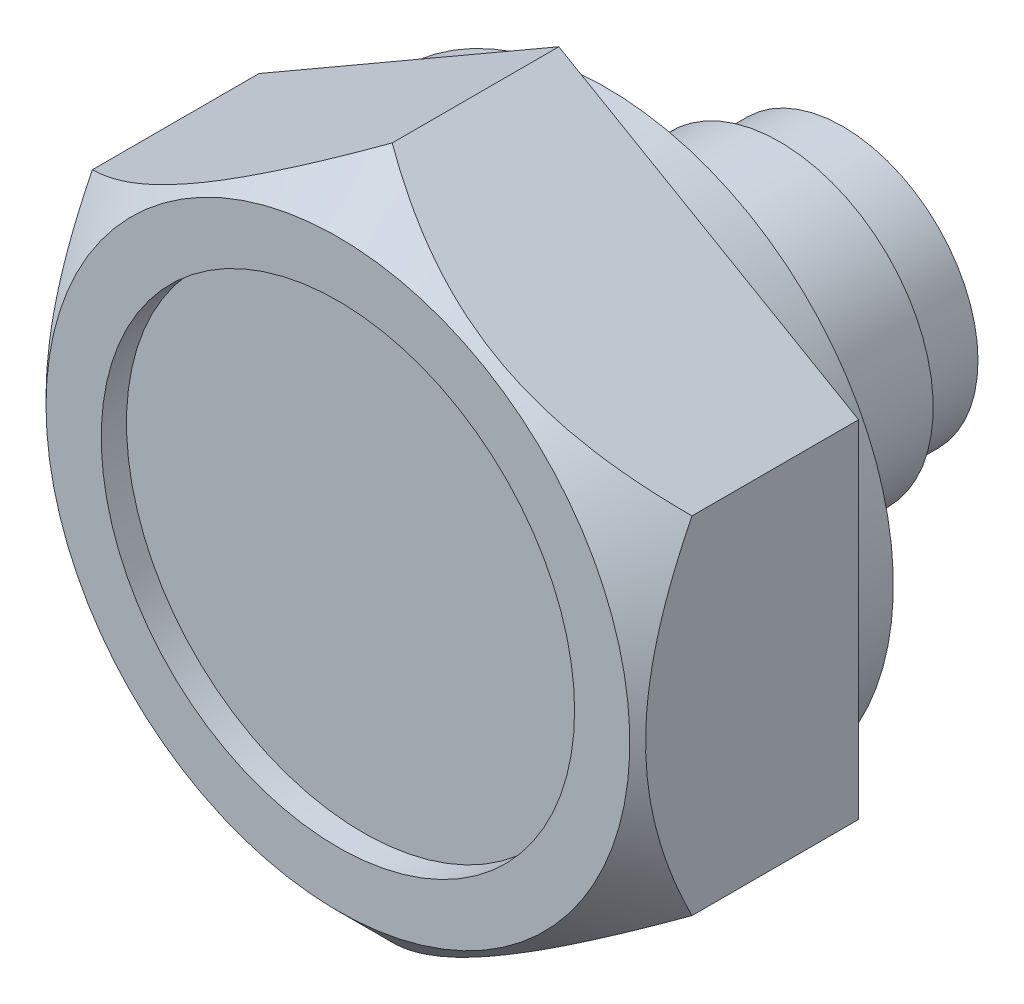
ISO-10303-21;
HEADER;
FILE_DESCRIPTION(('STEP AP214'),'2;1');
FILE_NAME('part.step','',(''),(''),'','','');
FILE_SCHEMA(('AUTOMOTIVE_DESIGN { 1 0 10303 214 1 1 1 1 }'));
ENDSEC;
DATA;
#1=APPLICATION_CONTEXT('core data for automotive mechanical design processes');
#2=APPLICATION_PROTOCOL_DEFINITION('international standard','automotive_design',2000,#1);
#3=PRODUCT_CONTEXT('',#1,'mechanical');
#4=PRODUCT('Part','Part','',(#3));
#5=PRODUCT_RELATED_PRODUCT_CATEGORY('part','',(#4));
#6=PRODUCT_DEFINITION_FORMATION('','',#4);
#7=PRODUCT_DEFINITION_CONTEXT('part definition',#1,'design');
#8=PRODUCT_DEFINITION('design','',#6,#7);
#9=PRODUCT_DEFINITION_SHAPE('','',#8);
#10=(LENGTH_UNIT() NAMED_UNIT(*) SI_UNIT(.MILLI.,.METRE.));
#11=(NAMED_UNIT(*) PLANE_ANGLE_UNIT() SI_UNIT($,.RADIAN.));
#12=(NAMED_UNIT(*) SI_UNIT($,.STERADIAN.) SOLID_ANGLE_UNIT());
#13=UNCERTAINTY_MEASURE_WITH_UNIT(LENGTH_MEASURE(1.E-05),#10,'distance_accuracy_value','');
#14=(GEOMETRIC_REPRESENTATION_CONTEXT(3) GLOBAL_UNCERTAINTY_ASSIGNED_CONTEXT((#13)) GLOBAL_UNIT_ASSIGNED_CONTEXT((#10,
#11,#12)) REPRESENTATION_CONTEXT('',''));
#15=CARTESIAN_POINT('',(0.,0.,0.));
#16=DIRECTION('',(0.,0.,1.));
#17=DIRECTION('',(1.,0.,0.));
#18=AXIS2_PLACEMENT_3D('',#15,#16,#17);
#19=CARTESIAN_POINT('',(0.,9.1,1.5));
#20=DIRECTION('',(0.,0.,-1.));
#21=DIRECTION('',(-1.,0.,0.));
#22=AXIS2_PLACEMENT_3D('',#19,#20,#21);
#23=PLANE('',#22);
#24=CARTESIAN_POINT('',(0.,0.,1.5));
#25=DIRECTION('',(0.,0.,-1.));
#26=DIRECTION('',(-1.,0.,0.));
#27=AXIS2_PLACEMENT_3D('',#24,#25,#26);
#28=CIRCLE('',#27,9.1);
#29=CARTESIAN_POINT('',(-9.1,0.,1.5));
#30=VERTEX_POINT('',#29);
#31=EDGE_CURVE('E131',#30,#30,#28,.T.);
#32=ORIENTED_EDGE('',*,*,#31,.F.);
#33=EDGE_LOOP('',(#32));
#34=FACE_BOUND('',#33,.T.);
#35=DIRECTION('',(-0.866025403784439,-0.5,0.));
#36=VECTOR('',#35,1.);
#37=CARTESIAN_POINT('',(-0.809584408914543,10.5022413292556,1.5));
#38=LINE('',#37,#36);
#39=CARTESIAN_POINT('',(-1.18559675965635E-11,10.9696551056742,1.5));
#40=VERTEX_POINT('',#39);
#41=CARTESIAN_POINT('',(-9.49999999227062,5.4848275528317,1.5));
#42=VERTEX_POINT('',#41);
#43=EDGE_CURVE('E124',#40,#42,#38,.T.);
#44=ORIENTED_EDGE('',*,*,#43,.F.);
#45=DIRECTION('',(-0.866025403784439,0.5,0.));
#46=VECTOR('',#45,1.);
#47=CARTESIAN_POINT('',(0.809584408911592,10.5022413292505,1.5));
#48=LINE('',#47,#46);
#49=CARTESIAN_POINT('',(9.49999999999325,5.4848275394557,1.5));
#50=VERTEX_POINT('',#49);
#51=EDGE_CURVE('E120',#50,#40,#48,.T.);
#52=ORIENTED_EDGE('',*,*,#51,.F.);
#53=DIRECTION('',(7.05455308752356E-10,1.,0.));
#54=VECTOR('',#53,1.);
#55=CARTESIAN_POINT('',(9.5000000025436,9.09999999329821,1.5));
#56=LINE('',#55,#54);
#57=CARTESIAN_POINT('',(9.49999999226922,-5.48482755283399,1.5));
#58=VERTEX_POINT('',#57);
#59=EDGE_CURVE('E42',#58,#50,#56,.T.);
#60=ORIENTED_EDGE('',*,*,#59,.F.);
#61=DIRECTION('',(0.866025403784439,0.5,0.));
#62=VECTOR('',#61,1.);
#63=CARTESIAN_POINT('',(8.69041558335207,-5.95224132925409,1.5));
#64=LINE('',#63,#62);
#65=CARTESIAN_POINT('',(-3.68108321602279E-12,-10.9696551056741,1.5));
#66=VERTEX_POINT('',#65);
#67=EDGE_CURVE('E37',#66,#58,#64,.T.);
#68=ORIENTED_EDGE('',*,*,#67,.F.);
#69=DIRECTION('',(0.866025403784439,-0.5,0.));
#70=VECTOR('',#69,1.);
#71=CARTESIAN_POINT('',(-8.69041558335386,-5.9522413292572,1.5));
#72=LINE('',#71,#70);
#73=CARTESIAN_POINT('',(-9.49999999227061,-5.48482755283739,1.5));
#74=VERTEX_POINT('',#73);
#75=EDGE_CURVE('E70',#74,#66,#72,.T.);
#76=ORIENTED_EDGE('',*,*,#75,.F.);
#77=DIRECTION('',(0.,-1.,0.));
#78=VECTOR('',#77,1.);
#79=CARTESIAN_POINT('',(-9.49999999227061,9.1,1.5));
#80=LINE('',#79,#78);
#81=EDGE_CURVE('E72',#42,#74,#80,.T.);
#82=ORIENTED_EDGE('',*,*,#81,.F.);
#83=EDGE_LOOP('',(#44,#52,#60,#68,#76,#82));
#84=FACE_BOUND('',#83,.T.);
#85=ADVANCED_FACE('F15',(#34,#84),#23,.T.);
#86=CARTESIAN_POINT('',(0.,0.,-7.5000000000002));
#87=DIRECTION('',(0.,0.,-1.));
#88=DIRECTION('',(-1.,0.,0.));
#89=AXIS2_PLACEMENT_3D('',#86,#87,#88);
#90=PLANE('',#89);
#91=CARTESIAN_POINT('',(0.,0.,-7.5));
#92=DIRECTION('',(0.,0.,-1.));
#93=DIRECTION('',(-1.,0.,0.));
#94=AXIS2_PLACEMENT_3D('',#91,#92,#93);
#95=CIRCLE('',#94,4.283);
#96=CARTESIAN_POINT('',(-4.283,0.,-7.5));
#97=VERTEX_POINT('',#96);
#98=EDGE_CURVE('E151',#97,#97,#95,.T.);
#99=ORIENTED_EDGE('',*,*,#98,.T.);
#100=EDGE_LOOP('',(#99));
#101=FACE_BOUND('',#100,.T.);
#102=ADVANCED_FACE('F17',(#101),#90,.T.);
#103=CARTESIAN_POINT('',(0.,0.,-10.0495824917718));
#104=DIRECTION('',(0.,0.,-1.));
#105=DIRECTION('',(-1.,0.,0.));
#106=AXIS2_PLACEMENT_3D('',#103,#104,#105);
#107=CYLINDRICAL_SURFACE('',#106,4.283);
#108=ORIENTED_EDGE('',*,*,#98,.F.);
#109=EDGE_LOOP('',(#108));
#110=FACE_BOUND('',#109,.T.);
#111=CARTESIAN_POINT('',(0.,0.,-5.5));
#112=DIRECTION('',(0.,0.,-1.));
#113=DIRECTION('',(-1.,0.,0.));
#114=AXIS2_PLACEMENT_3D('',#111,#112,#113);
#115=CIRCLE('',#114,4.283);
#116=CARTESIAN_POINT('',(-4.283,0.,-5.5));
#117=VERTEX_POINT('',#116);
#118=EDGE_CURVE('E147',#117,#117,#115,.T.);
#119=ORIENTED_EDGE('',*,*,#118,.T.);
#120=EDGE_LOOP('',(#119));
#121=FACE_BOUND('',#120,.T.);
#122=ADVANCED_FACE('F230',(#110,#121),#107,.T.);
#123=CARTESIAN_POINT('',(0.,4.28300000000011,-5.5));
#124=DIRECTION('',(0.,0.,-1.));
#125=DIRECTION('',(-1.,0.,0.));
#126=AXIS2_PLACEMENT_3D('',#123,#124,#125);
#127=PLANE('',#126);
#128=CARTESIAN_POINT('',(0.,0.,-5.5));
#129=DIRECTION('',(0.,0.,-1.));
#130=DIRECTION('',(-1.,0.,0.));
#131=AXIS2_PLACEMENT_3D('',#128,#129,#130);
#132=CIRCLE('',#131,4.864);
#133=CARTESIAN_POINT('',(-4.864,0.,-5.5));
#134=VERTEX_POINT('',#133);
#135=EDGE_CURVE('E143',#134,#134,#132,.T.);
#136=ORIENTED_EDGE('',*,*,#135,.T.);
#137=EDGE_LOOP('',(#136));
#138=FACE_BOUND('',#137,.T.);
#139=ORIENTED_EDGE('',*,*,#118,.F.);
#140=EDGE_LOOP('',(#139));
#141=FACE_BOUND('',#140,.T.);
#142=ADVANCED_FACE('F247',(#138,#141),#127,.T.);
#143=CARTESIAN_POINT('',(0.,0.,-10.0495824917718));
#144=DIRECTION('',(0.,0.,-1.));
#145=DIRECTION('',(-1.,0.,0.));
#146=AXIS2_PLACEMENT_3D('',#143,#144,#145);
#147=CYLINDRICAL_SURFACE('',#146,4.864);
#148=ORIENTED_EDGE('',*,*,#135,.F.);
#149=EDGE_LOOP('',(#148));
#150=FACE_BOUND('',#149,.T.);
#151=CARTESIAN_POINT('',(0.,0.,0.));
#152=DIRECTION('',(0.,0.,-1.));
#153=DIRECTION('',(-1.,0.,0.));
#154=AXIS2_PLACEMENT_3D('',#151,#152,#153);
#155=CIRCLE('',#154,4.864);
#156=CARTESIAN_POINT('',(-4.864,0.,0.));
#157=VERTEX_POINT('',#156);
#158=EDGE_CURVE('E139',#157,#157,#155,.T.);
#159=ORIENTED_EDGE('',*,*,#158,.T.);
#160=EDGE_LOOP('',(#159));
#161=FACE_BOUND('',#160,.T.);
#162=ADVANCED_FACE('F242',(#150,#161),#147,.T.);
#163=CARTESIAN_POINT('',(0.,4.864,0.));
#164=DIRECTION('',(0.,0.,-1.));
#165=DIRECTION('',(-1.,0.,0.));
#166=AXIS2_PLACEMENT_3D('',#163,#164,#165);
#167=PLANE('',#166);
#168=CARTESIAN_POINT('',(0.,0.,0.));
#169=DIRECTION('',(0.,0.,-1.));
#170=DIRECTION('',(-1.,0.,0.));
#171=AXIS2_PLACEMENT_3D('',#168,#169,#170);
#172=CIRCLE('',#171,9.1);
#173=CARTESIAN_POINT('',(-9.1,0.,0.));
#174=VERTEX_POINT('',#173);
#175=EDGE_CURVE('E135',#174,#174,#172,.T.);
#176=ORIENTED_EDGE('',*,*,#175,.T.);
#177=EDGE_LOOP('',(#176));
#178=FACE_BOUND('',#177,.T.);
#179=ORIENTED_EDGE('',*,*,#158,.F.);
#180=EDGE_LOOP('',(#179));
#181=FACE_BOUND('',#180,.T.);
#182=ADVANCED_FACE('F237',(#178,#181),#167,.T.);
#183=CARTESIAN_POINT('',(0.,0.,-10.0495824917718));
#184=DIRECTION('',(0.,0.,-1.));
#185=DIRECTION('',(-1.,0.,0.));
#186=AXIS2_PLACEMENT_3D('',#183,#184,#185);
#187=CYLINDRICAL_SURFACE('',#186,9.1);
#188=ORIENTED_EDGE('',*,*,#31,.T.);
#189=EDGE_LOOP('',(#188));
#190=FACE_BOUND('',#189,.T.);
#191=ORIENTED_EDGE('',*,*,#175,.F.);
#192=EDGE_LOOP('',(#191));
#193=FACE_BOUND('',#192,.T.);
#194=ADVANCED_FACE('F234',(#190,#193),#187,.T.);
#195=CARTESIAN_POINT('',(-9.49999999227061,5.4848275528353,-7.5));
#196=DIRECTION('',(0.5,-0.866025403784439,0.));
#197=DIRECTION('',(-0.866025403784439,-0.5,0.));
#198=AXIS2_PLACEMENT_3D('',#195,#196,#197);
#199=PLANE('',#198);
#200=DIRECTION('',(0.,0.,1.));
#201=VECTOR('',#200,1.);
#202=CARTESIAN_POINT('',(-5.90499871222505E-12,10.9696551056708,-7.5));
#203=LINE('',#202,#201);
#204=CARTESIAN_POINT('',(-5.90499871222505E-12,10.9696551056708,6.7803448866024));
#205=VERTEX_POINT('',#204);
#206=EDGE_CURVE('E88',#40,#205,#203,.T.);
#207=ORIENTED_EDGE('',*,*,#206,.F.);
#208=ORIENTED_EDGE('',*,*,#43,.T.);
#209=DIRECTION('',(0.,0.,1.));
#210=VECTOR('',#209,1.);
#211=CARTESIAN_POINT('',(-9.49999999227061,5.4848275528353,-7.5));
#212=LINE('',#211,#210);
#213=CARTESIAN_POINT('',(-9.49999999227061,5.4848275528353,6.78034488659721));
#214=VERTEX_POINT('',#213);
#215=EDGE_CURVE('E86',#42,#214,#212,.T.);
#216=ORIENTED_EDGE('',*,*,#215,.T.);
#217=CARTESIAN_POINT('',(0.000199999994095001,10.9697705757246,6.78022941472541));
#218=CARTESIAN_POINT('',(-0.163127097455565,10.8754736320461,6.8745130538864));
#219=CARTESIAN_POINT('',(-0.327733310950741,10.7804381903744,6.96591968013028));
#220=CARTESIAN_POINT('',(-0.659703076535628,10.5887753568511,7.14206501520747));
#221=CARTESIAN_POINT('',(-0.827068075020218,10.4921471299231,7.22680008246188));
#222=CARTESIAN_POINT('',(-1.16554392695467,10.2967280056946,7.389047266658));
#223=CARTESIAN_POINT('',(-1.3366707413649,10.1979278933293,7.46651524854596));
#224=CARTESIAN_POINT('',(-1.68173507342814,9.99870490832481,7.61254572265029));
#225=CARTESIAN_POINT('',(-1.85567215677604,9.89828228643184,7.68110957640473));
#226=CARTESIAN_POINT('',(-2.20356038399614,9.69742892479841,7.80716241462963));
#227=CARTESIAN_POINT('',(-2.37746877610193,9.5970228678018,7.86480781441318));
#228=CARTESIAN_POINT('',(-2.72772345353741,9.3948032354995,7.96916953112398));
#229=CARTESIAN_POINT('',(-2.90406947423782,9.2929898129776,8.01588702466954));
#230=CARTESIAN_POINT('',(-3.2584451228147,9.08839093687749,8.0972167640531));
#231=CARTESIAN_POINT('',(-3.43647001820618,8.98560821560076,8.13185625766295));
#232=CARTESIAN_POINT('',(-3.7940143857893,8.77917987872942,8.18826883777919));
#233=CARTESIAN_POINT('',(-3.97353363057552,8.6755343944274,8.21004384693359));
#234=CARTESIAN_POINT('',(-4.41100623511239,8.42295946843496,8.24655435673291));
#235=CARTESIAN_POINT('',(-4.66943244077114,8.2737570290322,8.2542160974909));
#236=CARTESIAN_POINT('',(-5.18581747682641,7.97562198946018,8.24135626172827));
#237=CARTESIAN_POINT('',(-5.44377611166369,7.82668950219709,8.2208248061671));
#238=CARTESIAN_POINT('',(-5.95726173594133,7.5302284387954,8.15279045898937));
#239=CARTESIAN_POINT('',(-6.21278568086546,7.38270162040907,8.10525740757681));
#240=CARTESIAN_POINT('',(-6.71944160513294,7.09018368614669,7.98580361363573));
#241=CARTESIAN_POINT('',(-6.97057391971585,6.94519237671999,7.91388474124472));
#242=CARTESIAN_POINT('',(-7.41636798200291,6.68781305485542,7.76592936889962));
#243=CARTESIAN_POINT('',(-7.61201705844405,6.57485500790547,7.69378482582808));
#244=CARTESIAN_POINT('',(-7.9998032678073,6.3509665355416,7.53787046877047));
#245=CARTESIAN_POINT('',(-8.19194029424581,6.24003617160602,7.45410030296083));
#246=CARTESIAN_POINT('',(-8.57209722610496,6.02055246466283,7.27681237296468));
#247=CARTESIAN_POINT('',(-8.7601279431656,5.91199287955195,7.18332526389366));
#248=CARTESIAN_POINT('',(-9.13270777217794,5.69688381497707,6.98783068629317));
#249=CARTESIAN_POINT('',(-9.31725893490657,5.59033315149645,6.8858284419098));
#250=CARTESIAN_POINT('',(-9.50019999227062,5.48471208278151,6.7802294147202));
#251=B_SPLINE_CURVE_WITH_KNOTS('',3,(#217,#218,#219,#220,#221,#222,#223,#224,#225,#226,#227,
#228,#229,#230,#231,#232,#233,#234,#235,#236,#237,#238,#239,#240,#241,#242,#243,#244,#245,#246,
#247,#248,#249,#250),.UNSPECIFIED.,.F.,.F.,(4,2,2,2,2,2,2,2,2,2,2,2,2,2,2,2,4),(0.,
0.632572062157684,1.26548704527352,1.90202596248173,2.53846743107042,3.16495668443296,
3.79137845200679,4.41637773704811,5.04128358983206,5.93539755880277,6.82982490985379,
7.72525327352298,8.62061298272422,9.33174688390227,10.0429023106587,10.7518786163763,
11.4604231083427),.UNSPECIFIED.);
#252=EDGE_CURVE('E9',#205,#214,#251,.T.);
#253=ORIENTED_EDGE('',*,*,#252,.F.);
#254=EDGE_LOOP('',(#207,#208,#216,#253));
#255=FACE_BOUND('',#254,.T.);
#256=ADVANCED_FACE('F208',(#255),#199,.F.);
#257=CARTESIAN_POINT('',(-5.90499871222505E-12,10.9696551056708,-7.5));
#258=DIRECTION('',(-0.5,-0.866025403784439,0.));
#259=DIRECTION('',(-0.866025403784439,0.5,0.));
#260=AXIS2_PLACEMENT_3D('',#257,#258,#259);
#261=PLANE('',#260);
#262=DIRECTION('',(0.,0.,1.));
#263=VECTOR('',#262,1.);
#264=CARTESIAN_POINT('',(9.49999999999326,5.48482754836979,-7.5));
#265=LINE('',#264,#263);
#266=CARTESIAN_POINT('',(9.49999999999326,5.48482754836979,6.7803448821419));
#267=VERTEX_POINT('',#266);
#268=EDGE_CURVE('E109',#50,#267,#265,.T.);
#269=ORIENTED_EDGE('',*,*,#268,.F.);
#270=ORIENTED_EDGE('',*,*,#51,.T.);
#271=ORIENTED_EDGE('',*,*,#206,.T.);
#272=CARTESIAN_POINT('',(9.50019999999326,5.48471207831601,6.78022941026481));
#273=CARTESIAN_POINT('',(9.33687290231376,5.57900902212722,6.87451304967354));
#274=CARTESIAN_POINT('',(9.17226668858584,5.67404446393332,6.96591967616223));
#275=CARTESIAN_POINT('',(8.84029692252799,5.86570729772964,7.1420650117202));
#276=CARTESIAN_POINT('',(8.67293192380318,5.96233552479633,7.22680007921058));
#277=CARTESIAN_POINT('',(8.33445607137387,6.15775464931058,7.38904726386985));
#278=CARTESIAN_POINT('',(8.16332925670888,6.25655476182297,7.4665152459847));
#279=CARTESIAN_POINT('',(7.81826492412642,6.45577774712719,7.61254572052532));
#280=CARTESIAN_POINT('',(7.64432784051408,6.55620036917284,7.68110957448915));
#281=CARTESIAN_POINT('',(7.29643961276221,6.75705373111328,7.80716241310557));
#282=CARTESIAN_POINT('',(7.12253122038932,6.85745978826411,7.86480781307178));
#283=CARTESIAN_POINT('',(6.77227654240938,7.05967942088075,7.96916953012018));
#284=CARTESIAN_POINT('',(6.5959305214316,7.16149284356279,8.01588702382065));
#285=CARTESIAN_POINT('',(6.2415548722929,7.36609171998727,8.0972167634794));
#286=CARTESIAN_POINT('',(6.06352997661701,7.46887444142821,8.13185625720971));
#287=CARTESIAN_POINT('',(5.70598560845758,7.67530277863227,8.18826883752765));
#288=CARTESIAN_POINT('',(5.52646636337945,7.77894826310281,8.21004384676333));
#289=CARTESIAN_POINT('',(5.08899375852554,8.03152318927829,8.24655435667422));
#290=CARTESIAN_POINT('',(4.83056755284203,8.18072562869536,8.25421609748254));
#291=CARTESIAN_POINT('',(4.31418251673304,8.47886066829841,8.24135626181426));
#292=CARTESIAN_POINT('',(4.0562238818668,8.62779315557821,8.22082480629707));
#293=CARTESIAN_POINT('',(3.54273825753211,8.92425421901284,8.15279045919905));
#294=CARTESIAN_POINT('',(3.28721431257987,9.07178103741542,8.10525740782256));
#295=CARTESIAN_POINT('',(2.78055838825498,9.3642989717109,7.98580361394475));
#296=CARTESIAN_POINT('',(2.52942607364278,9.50929028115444,7.91388474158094));
#297=CARTESIAN_POINT('',(2.08363201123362,9.76666960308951,7.76592936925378));
#298=CARTESIAN_POINT('',(1.88798293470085,9.87962765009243,7.69378482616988));
#299=CARTESIAN_POINT('',(1.50019672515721,10.1035161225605,7.53787046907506));
#300=CARTESIAN_POINT('',(1.30805969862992,10.2144464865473,7.45410030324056));
#301=CARTESIAN_POINT('',(0.927902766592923,10.4339301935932,7.27681237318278));
#302=CARTESIAN_POINT('',(0.73987204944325,10.5424897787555,7.18332526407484));
#303=CARTESIAN_POINT('',(0.367292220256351,10.7575988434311,6.98783068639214));
#304=CARTESIAN_POINT('',(0.182741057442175,10.8641495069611,6.8858284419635));
#305=CARTESIAN_POINT('',(-0.000200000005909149,10.9697705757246,6.78022941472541));
#306=B_SPLINE_CURVE_WITH_KNOTS('',3,(#272,#273,#274,#275,#276,#277,#278,#279,#280,#281,#282,
#283,#284,#285,#286,#287,#288,#289,#290,#291,#292,#293,#294,#295,#296,#297,#298,#299,#300,#301,
#302,#303,#304,#305),.UNSPECIFIED.,.F.,.F.,(4,2,2,2,2,2,2,2,2,2,2,2,2,2,2,2,4),(0.,
0.632572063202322,1.26548704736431,1.90202596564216,2.53846743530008,3.16495668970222,
3.79137845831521,4.41637774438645,5.04128359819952,5.93539756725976,6.82982491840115,
7.72525328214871,8.62061299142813,9.33174689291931,10.0429023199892,10.7518786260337,
11.4604231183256),.UNSPECIFIED.);
#307=EDGE_CURVE('E30',#267,#205,#306,.T.);
#308=ORIENTED_EDGE('',*,*,#307,.F.);
#309=EDGE_LOOP('',(#269,#270,#271,#308));
#310=FACE_BOUND('',#309,.T.);
#311=ADVANCED_FACE('F204',(#310),#261,.F.);
#312=CARTESIAN_POINT('',(9.49999999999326,5.48482754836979,-7.5));
#313=DIRECTION('',(-1.,7.05455308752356E-10,0.));
#314=DIRECTION('',(7.05455308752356E-10,1.,0.));
#315=AXIS2_PLACEMENT_3D('',#312,#313,#314);
#316=PLANE('',#315);
#317=DIRECTION('',(0.,0.,1.));
#318=VECTOR('',#317,1.);
#319=CARTESIAN_POINT('',(9.49999999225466,-5.4848275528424,-7.5));
#320=LINE('',#319,#318);
#321=CARTESIAN_POINT('',(9.49999999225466,-5.4848275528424,6.78034488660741));
#322=VERTEX_POINT('',#321);
#323=EDGE_CURVE('E100',#58,#322,#320,.T.);
#324=ORIENTED_EDGE('',*,*,#323,.F.);
#325=ORIENTED_EDGE('',*,*,#59,.T.);
#326=ORIENTED_EDGE('',*,*,#268,.T.);
#327=CARTESIAN_POINT('',(9.49999998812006,-11.3457131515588,2.9521891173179));
#328=CARTESIAN_POINT('',(9.49999998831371,-11.0712135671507,3.1626048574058));
#329=CARTESIAN_POINT('',(9.49999998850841,-10.7952235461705,3.3711070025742));
#330=CARTESIAN_POINT('',(9.49999998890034,-10.2396575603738,3.78341323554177));
#331=CARTESIAN_POINT('',(9.49999998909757,-9.96008075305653,3.98721618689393));
#332=CARTESIAN_POINT('',(9.49999998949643,-9.39469204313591,4.39070371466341));
#333=CARTESIAN_POINT('',(9.49999998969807,-9.10884866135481,4.59034432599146));
#334=CARTESIAN_POINT('',(9.49999999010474,-8.53238522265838,4.98258231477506));
#335=CARTESIAN_POINT('',(9.49999999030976,-8.24176549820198,5.1751801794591));
#336=CARTESIAN_POINT('',(9.4999999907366,-7.63671605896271,5.56343906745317));
#337=CARTESIAN_POINT('',(9.49999999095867,-7.3219292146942,5.75854635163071));
#338=CARTESIAN_POINT('',(9.49999999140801,-6.68497023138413,6.13651280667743));
#339=CARTESIAN_POINT('',(9.49999999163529,-6.36279687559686,6.31936993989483));
#340=CARTESIAN_POINT('',(9.49999999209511,-5.71099984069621,6.66893162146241));
#341=CARTESIAN_POINT('',(9.49999999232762,-5.38140180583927,6.83568361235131));
#342=CARTESIAN_POINT('',(9.49999999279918,-4.71295092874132,7.14929937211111));
#343=CARTESIAN_POINT('',(9.49999999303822,-4.37410250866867,7.29617245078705));
#344=CARTESIAN_POINT('',(9.49999999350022,-3.71920448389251,7.5519343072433));
#345=CARTESIAN_POINT('',(9.49999999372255,-3.40405655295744,7.66310834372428));
#346=CARTESIAN_POINT('',(9.4999999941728,-2.76581761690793,7.86022157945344));
#347=CARTESIAN_POINT('',(9.49999999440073,-2.44272609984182,7.94615914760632));
#348=CARTESIAN_POINT('',(9.49999999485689,-1.79610559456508,8.08674929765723));
#349=CARTESIAN_POINT('',(9.49999999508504,-1.47270082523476,8.14196366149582));
#350=CARTESIAN_POINT('',(9.49999999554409,-0.821982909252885,8.21997024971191));
#351=CARTESIAN_POINT('',(9.49999999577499,-0.494670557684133,8.24276896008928));
#352=CARTESIAN_POINT('',(9.49999999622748,0.14674316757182,8.25405061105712));
#353=CARTESIAN_POINT('',(9.49999999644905,0.460820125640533,8.24393888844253));
#354=CARTESIAN_POINT('',(9.49999999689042,1.08647769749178,8.19316178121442));
#355=CARTESIAN_POINT('',(9.49999999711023,1.39805807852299,8.15249358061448));
#356=CARTESIAN_POINT('',(9.49999999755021,2.02174480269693,8.04219578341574));
#357=CARTESIAN_POINT('',(9.49999999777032,2.33375985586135,7.97205855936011));
#358=CARTESIAN_POINT('',(9.49999999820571,2.95093459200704,7.80668398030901));
#359=CARTESIAN_POINT('',(9.49999999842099,3.25609470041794,7.7114481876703));
#360=CARTESIAN_POINT('',(9.49999999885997,3.87836919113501,7.49322629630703));
#361=CARTESIAN_POINT('',(9.49999999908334,4.19499042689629,7.36884953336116));
#362=CARTESIAN_POINT('',(9.49999999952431,4.82007561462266,7.10090043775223));
#363=CARTESIAN_POINT('',(9.49999999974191,5.12853579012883,6.95731939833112));
#364=CARTESIAN_POINT('',(9.5000000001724,5.7387642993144,6.6543683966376));
#365=CARTESIAN_POINT('',(9.50000000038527,6.04050820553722,6.49494962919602));
#366=CARTESIAN_POINT('',(9.50000000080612,6.63707674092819,6.16383409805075));
#367=CARTESIAN_POINT('',(9.50000000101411,6.93190243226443,5.99213923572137));
#368=CARTESIAN_POINT('',(9.50000000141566,7.50111584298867,5.64760336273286));
#369=CARTESIAN_POINT('',(9.50000000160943,7.77579338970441,5.47523865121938));
#370=CARTESIAN_POINT('',(9.50000000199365,8.32042982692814,5.12318704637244));
#371=CARTESIAN_POINT('',(9.50000000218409,8.59038836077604,4.94349960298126));
#372=CARTESIAN_POINT('',(9.50000000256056,9.12403033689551,4.57957545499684));
#373=CARTESIAN_POINT('',(9.5000000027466,9.38774679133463,4.39538698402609));
#374=CARTESIAN_POINT('',(9.50000000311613,9.91156408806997,4.02208356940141));
#375=CARTESIAN_POINT('',(9.50000000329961,10.1716659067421,3.83296999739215));
#376=CARTESIAN_POINT('',(9.50000000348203,10.4302518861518,3.64184084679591));
#377=B_SPLINE_CURVE_WITH_KNOTS('',3,(#327,#328,#329,#330,#331,#332,#333,#334,#335,#336,#337,
#338,#339,#340,#341,#342,#343,#344,#345,#346,#347,#348,#349,#350,#351,#352,#353,#354,#355,#356,
#357,#358,#359,#360,#361,#362,#363,#364,#365,#366,#367,#368,#369,#370,#371,#372,#373,#374,#375,
#376),.UNSPECIFIED.,.F.,.F.,(4,2,2,2,2,2,2,2,2,2,2,2,2,2,2,2,2,2,2,2,2,2,2,2,4),(0.,
1.03762389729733,2.0754961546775,3.12138434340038,4.16720003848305,5.27802227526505,
6.3890288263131,7.4966558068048,8.60376224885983,9.60544233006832,10.6071871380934,
11.5899563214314,12.5725288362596,13.5137031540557,14.4549642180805,15.4131508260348,
16.3712778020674,17.3910167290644,18.4112195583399,19.434669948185,20.4579621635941,
21.4306652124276,22.4034414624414,23.3683910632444,24.3330747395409),.UNSPECIFIED.);
#378=EDGE_CURVE('E192',#322,#267,#377,.T.);
#379=ORIENTED_EDGE('',*,*,#378,.F.);
#380=EDGE_LOOP('',(#324,#325,#326,#379));
#381=FACE_BOUND('',#380,.T.);
#382=ADVANCED_FACE('F207',(#381),#316,.F.);
#383=CARTESIAN_POINT('',(9.49999999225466,-5.4848275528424,-7.5));
#384=DIRECTION('',(-0.5,0.866025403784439,0.));
#385=DIRECTION('',(0.866025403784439,0.5,0.));
#386=AXIS2_PLACEMENT_3D('',#383,#384,#385);
#387=PLANE('',#386);
#388=DIRECTION('',(0.,0.,1.));
#389=VECTOR('',#388,1.);
#390=CARTESIAN_POINT('',(-3.56659146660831E-12,-10.9696551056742,-7.5));
#391=LINE('',#390,#389);
#392=CARTESIAN_POINT('',(-3.56659146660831E-12,-10.9696551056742,6.7803448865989));
#393=VERTEX_POINT('',#392);
#394=EDGE_CURVE('E95',#66,#393,#391,.T.);
#395=ORIENTED_EDGE('',*,*,#394,.F.);
#396=ORIENTED_EDGE('',*,*,#67,.T.);
#397=ORIENTED_EDGE('',*,*,#323,.T.);
#398=CARTESIAN_POINT('',(-0.000200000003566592,-10.969770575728,6.78022941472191));
#399=CARTESIAN_POINT('',(0.163127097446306,-10.8754736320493,6.87451305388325));
#400=CARTESIAN_POINT('',(0.327733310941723,-10.7804381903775,6.96591968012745));
#401=CARTESIAN_POINT('',(0.659703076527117,-10.5887753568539,7.14206501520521));
#402=CARTESIAN_POINT('',(0.827068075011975,-10.4921471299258,7.22680008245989));
#403=CARTESIAN_POINT('',(1.16554392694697,-10.2967280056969,7.38904726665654));
#404=CARTESIAN_POINT('',(1.33667074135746,-10.1979278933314,7.46651524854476));
#405=CARTESIAN_POINT('',(1.68173507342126,-9.99870490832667,7.6125457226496));
#406=CARTESIAN_POINT('',(1.85567215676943,-9.89828228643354,7.68110957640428));
#407=CARTESIAN_POINT('',(2.20356038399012,-9.69742892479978,7.80716241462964));
#408=CARTESIAN_POINT('',(2.37746877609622,-9.59702286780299,7.86480781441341));
#409=CARTESIAN_POINT('',(2.72772345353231,-9.39480323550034,7.96916953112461));
#410=CARTESIAN_POINT('',(2.90406947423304,-9.29298981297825,8.01588702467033));
#411=CARTESIAN_POINT('',(3.25844512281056,-9.08839093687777,8.09721676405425));
#412=CARTESIAN_POINT('',(3.43647001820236,-8.98560821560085,8.13185625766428));
#413=CARTESIAN_POINT('',(3.79401438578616,-8.77917987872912,8.18826883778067));
#414=CARTESIAN_POINT('',(3.97353363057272,-8.67553439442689,8.21004384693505));
#415=CARTESIAN_POINT('',(4.41100623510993,-8.42295946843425,8.24655435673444));
#416=CARTESIAN_POINT('',(4.66943244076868,-8.27375702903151,8.25421609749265));
#417=CARTESIAN_POINT('',(5.18581747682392,-7.97562198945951,8.24135626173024));
#418=CARTESIAN_POINT('',(5.44377611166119,-7.82668950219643,8.22082480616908));
#419=CARTESIAN_POINT('',(5.9572617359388,-7.53022843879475,8.15279045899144));
#420=CARTESIAN_POINT('',(6.2127856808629,-7.38270162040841,8.10525740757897));
#421=CARTESIAN_POINT('',(6.71944160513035,-7.0901836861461,7.98580361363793));
#422=CARTESIAN_POINT('',(6.97057391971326,-6.94519237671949,7.91388474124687));
#423=CARTESIAN_POINT('',(7.41636798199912,-6.68781305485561,7.76592936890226));
#424=CARTESIAN_POINT('',(7.61201705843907,-6.57485500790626,7.6937848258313));
#425=CARTESIAN_POINT('',(7.99980326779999,-6.35096653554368,7.53787046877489));
#426=CARTESIAN_POINT('',(8.19194029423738,-6.24003617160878,7.45410030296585));
#427=CARTESIAN_POINT('',(8.57209722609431,-6.02055246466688,7.27681237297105));
#428=CARTESIAN_POINT('',(8.76012794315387,-5.91199287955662,7.18332526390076));
#429=CARTESIAN_POINT('',(9.13270777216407,-5.69688381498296,6.9878306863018));
#430=CARTESIAN_POINT('',(9.31725893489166,-5.59033315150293,6.88582844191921));
#431=CARTESIAN_POINT('',(9.50019999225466,-5.48471208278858,6.7802294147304));
#432=B_SPLINE_CURVE_WITH_KNOTS('',3,(#398,#399,#400,#401,#402,#403,#404,#405,#406,#407,#408,
#409,#410,#411,#412,#413,#414,#415,#416,#417,#418,#419,#420,#421,#422,#423,#424,#425,#426,#427,
#428,#429,#430,#431),.UNSPECIFIED.,.F.,.F.,(4,2,2,2,2,2,2,2,2,2,2,2,2,2,2,2,4),(0.,
0.632572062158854,1.26548704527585,1.90202596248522,2.53846743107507,3.16495668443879,
3.79137845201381,4.41637773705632,5.04128358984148,5.93539755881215,6.82982490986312,
7.72525327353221,8.62061298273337,9.33174688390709,10.0429023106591,10.7518786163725,
11.4604231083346),.UNSPECIFIED.);
#433=EDGE_CURVE('E185',#393,#322,#432,.T.);
#434=ORIENTED_EDGE('',*,*,#433,.F.);
#435=EDGE_LOOP('',(#395,#396,#397,#434));
#436=FACE_BOUND('',#435,.T.);
#437=ADVANCED_FACE('F212',(#436),#387,.F.);
#438=CARTESIAN_POINT('',(-3.56659146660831E-12,-10.9696551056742,-7.5));
#439=DIRECTION('',(0.5,0.866025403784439,0.));
#440=DIRECTION('',(0.866025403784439,-0.5,0.));
#441=AXIS2_PLACEMENT_3D('',#438,#439,#440);
#442=PLANE('',#441);
#443=DIRECTION('',(0.,0.,1.));
#444=VECTOR('',#443,1.);
#445=CARTESIAN_POINT('',(-9.49999999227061,-5.48482755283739,-7.5));
#446=LINE('',#445,#444);
#447=CARTESIAN_POINT('',(-9.49999999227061,-5.4848275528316,6.780344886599));
#448=VERTEX_POINT('',#447);
#449=EDGE_CURVE('E83',#74,#448,#446,.T.);
#450=ORIENTED_EDGE('',*,*,#449,.F.);
#451=ORIENTED_EDGE('',*,*,#75,.T.);
#452=ORIENTED_EDGE('',*,*,#394,.T.);
#453=CARTESIAN_POINT('',(-9.50019999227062,-5.48471208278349,6.78022941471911));
#454=CARTESIAN_POINT('',(-9.33687289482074,-5.57900902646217,6.87451305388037));
#455=CARTESIAN_POINT('',(-9.17226668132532,-5.67404446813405,6.96591968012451));
#456=CARTESIAN_POINT('',(-8.84029691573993,-5.8657073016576,7.14206501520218));
#457=CARTESIAN_POINT('',(-8.67293191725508,-5.96233552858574,7.22680008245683));
#458=CARTESIAN_POINT('',(-8.3344560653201,-6.15775465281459,7.38904726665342));
#459=CARTESIAN_POINT('',(-8.16332925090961,-6.25655476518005,7.4665152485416));
#460=CARTESIAN_POINT('',(-7.81826491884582,-6.45577775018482,7.61254572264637));
#461=CARTESIAN_POINT('',(-7.64432783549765,-6.55620037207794,7.68110957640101));
#462=CARTESIAN_POINT('',(-7.29643960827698,-6.7570537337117,7.80716241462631));
#463=CARTESIAN_POINT('',(-7.12253121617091,-6.85745979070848,7.86480781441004));
#464=CARTESIAN_POINT('',(-6.77227653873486,-7.0596794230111,7.96916953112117));
#465=CARTESIAN_POINT('',(-6.59593051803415,-7.16149284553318,8.01588702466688));
#466=CARTESIAN_POINT('',(-6.24155486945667,-7.36609172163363,8.09721676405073));
#467=CARTESIAN_POINT('',(-6.06352997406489,-7.46887444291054,8.13185625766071));
#468=CARTESIAN_POINT('',(-5.70598560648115,-7.67530277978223,8.18826883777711));
#469=CARTESIAN_POINT('',(-5.52646636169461,-7.77894826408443,8.21004384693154));
#470=CARTESIAN_POINT('',(-5.08899375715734,-8.03152319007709,8.24655435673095));
#471=CARTESIAN_POINT('',(-4.83056755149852,-8.18072562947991,8.25421609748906));
#472=CARTESIAN_POINT('',(-4.3141825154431,-8.47886066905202,8.24135626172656));
#473=CARTESIAN_POINT('',(-4.05622388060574,-8.62779315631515,8.2208248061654));
#474=CARTESIAN_POINT('',(-3.54273825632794,-8.92425421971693,8.15279045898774));
#475=CARTESIAN_POINT('',(-3.28721431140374,-9.07178103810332,8.10525740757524));
#476=CARTESIAN_POINT('',(-2.78055838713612,-9.36429897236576,7.98580361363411));
#477=CARTESIAN_POINT('',(-2.52942607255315,-9.50929028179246,7.913884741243));
#478=CARTESIAN_POINT('',(-2.08363201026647,-9.7666696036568,7.76592936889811));
#479=CARTESIAN_POINT('',(-1.88798293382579,-9.87962765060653,7.69378482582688));
#480=CARTESIAN_POINT('',(-1.50019672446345,-10.1035161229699,7.53787046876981));
#481=CARTESIAN_POINT('',(-1.30805969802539,-10.2144464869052,7.45410030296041));
#482=CARTESIAN_POINT('',(-0.927902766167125,-10.4339301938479,7.27681237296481));
#483=CARTESIAN_POINT('',(-0.739872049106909,-10.5424897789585,7.18332526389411));
#484=CARTESIAN_POINT('',(-0.367292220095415,-10.7575988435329,6.98783068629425));
#485=CARTESIAN_POINT('',(-0.182741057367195,-10.8641495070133,6.88582844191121));
#486=CARTESIAN_POINT('',(0.000199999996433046,-10.969770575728,6.78022941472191));
#487=B_SPLINE_CURVE_WITH_KNOTS('',3,(#453,#454,#455,#456,#457,#458,#459,#460,#461,#462,#463,
#464,#465,#466,#467,#468,#469,#470,#471,#472,#473,#474,#475,#476,#477,#478,#479,#480,#481,#482,
#483,#484,#485,#486),.UNSPECIFIED.,.F.,.F.,(4,2,2,2,2,2,2,2,2,2,2,2,2,2,2,2,4),(0.,
0.632572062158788,1.26548704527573,1.90202596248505,2.53846743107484,3.16495668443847,
3.79137845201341,4.41637773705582,5.04128358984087,5.93539755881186,6.82982490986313,
7.72525327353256,8.62061298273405,9.33174688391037,10.042902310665,10.7518786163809,
11.4604231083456),.UNSPECIFIED.);
#488=EDGE_CURVE('E92',#448,#393,#487,.T.);
#489=ORIENTED_EDGE('',*,*,#488,.F.);
#490=EDGE_LOOP('',(#450,#451,#452,#489));
#491=FACE_BOUND('',#490,.T.);
#492=ADVANCED_FACE('F90',(#491),#442,.F.);
#493=CARTESIAN_POINT('',(-9.49999999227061,-5.48482755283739,-7.5));
#494=DIRECTION('',(1.,0.,0.));
#495=DIRECTION('',(0.,0.,-1.));
#496=AXIS2_PLACEMENT_3D('',#493,#494,#495);
#497=PLANE('',#496);
#498=ORIENTED_EDGE('',*,*,#215,.F.);
#499=ORIENTED_EDGE('',*,*,#81,.T.);
#500=ORIENTED_EDGE('',*,*,#449,.T.);
#501=CARTESIAN_POINT('',(-9.49999999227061,-11.3457131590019,2.9521891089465));
#502=CARTESIAN_POINT('',(-9.49999999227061,-11.0712135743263,3.1626048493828));
#503=CARTESIAN_POINT('',(-9.49999999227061,-10.7952235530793,3.3711069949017));
#504=CARTESIAN_POINT('',(-9.49999999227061,-10.2396575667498,3.78341322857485));
#505=CARTESIAN_POINT('',(-9.49999999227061,-9.96008075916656,3.9872161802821));
#506=CARTESIAN_POINT('',(-9.49999999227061,-9.39469204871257,4.39070370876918));
#507=CARTESIAN_POINT('',(-9.49999999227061,-9.10884866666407,4.59034432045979));
#508=CARTESIAN_POINT('',(-9.49999999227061,-8.53238522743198,4.98258230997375));
#509=CARTESIAN_POINT('',(-9.49999999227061,-8.24176550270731,5.17518017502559));
#510=CARTESIAN_POINT('',(-9.49999999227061,-7.63671606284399,5.56343906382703));
#511=CARTESIAN_POINT('',(-9.49999999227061,-7.32192921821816,5.75854634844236));
#512=CARTESIAN_POINT('',(-9.49999999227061,-6.6849702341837,6.13651280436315));
#513=CARTESIAN_POINT('',(-9.49999999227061,-6.36279687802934,6.31936993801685));
#514=CARTESIAN_POINT('',(-9.49999999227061,-5.71099984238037,6.66893162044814));
#515=CARTESIAN_POINT('',(-9.49999999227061,-5.38140180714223,6.83568361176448));
#516=CARTESIAN_POINT('',(-9.49999999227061,-4.71295092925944,7.14929937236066));
#517=CARTESIAN_POINT('',(-9.49999999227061,-4.37410250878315,7.29617245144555));
#518=CARTESIAN_POINT('',(-9.49999999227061,-3.71920448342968,7.5519343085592));
#519=CARTESIAN_POINT('',(-9.49999999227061,-3.40405655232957,7.66310834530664));
#520=CARTESIAN_POINT('',(-9.49999999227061,-2.76581761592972,7.86022158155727));
#521=CARTESIAN_POINT('',(-9.49999999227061,-2.44272609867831,7.94615914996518));
#522=CARTESIAN_POINT('',(-9.49999999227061,-1.79610559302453,8.0867493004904));
#523=CARTESIAN_POINT('',(-9.49999999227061,-1.47270082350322,8.14196366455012));
#524=CARTESIAN_POINT('',(-9.49999999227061,-0.821982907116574,8.21997025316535));
#525=CARTESIAN_POINT('',(-9.49999999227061,-0.494670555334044,8.24276896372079));
#526=CARTESIAN_POINT('',(-9.49999999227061,0.14674317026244,8.2540506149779));
#527=CARTESIAN_POINT('',(-9.49999999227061,0.460820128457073,8.2439388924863));
#528=CARTESIAN_POINT('',(-9.49999999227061,1.08647770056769,8.19316178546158));
#529=CARTESIAN_POINT('',(-9.49999999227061,1.39805808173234,8.15249358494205));
#530=CARTESIAN_POINT('',(-9.49999999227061,2.0217448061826,8.04219578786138));
#531=CARTESIAN_POINT('',(-9.49999999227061,2.33375985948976,7.97205856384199));
#532=CARTESIAN_POINT('',(-9.49999999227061,2.95093459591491,7.80668398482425));
#533=CARTESIAN_POINT('',(-9.49999999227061,3.25609470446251,7.71144819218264));
#534=CARTESIAN_POINT('',(-9.49999999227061,3.87836919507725,7.49322630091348));
#535=CARTESIAN_POINT('',(-9.49999999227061,4.19499043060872,7.36884953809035));
#536=CARTESIAN_POINT('',(-9.49999999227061,4.82007561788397,7.10090044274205));
#537=CARTESIAN_POINT('',(-9.49999999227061,5.12853579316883,6.95731940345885));
#538=CARTESIAN_POINT('',(-9.49999999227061,5.73876430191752,6.65436840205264));
#539=CARTESIAN_POINT('',(-9.49999999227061,6.04050820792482,6.49494963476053));
#540=CARTESIAN_POINT('',(-9.49999999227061,6.63707674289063,6.16383410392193));
#541=CARTESIAN_POINT('',(-9.49999999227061,6.93190243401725,5.99213924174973));
#542=CARTESIAN_POINT('',(-9.49999999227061,7.5011158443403,5.64760336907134));
#543=CARTESIAN_POINT('',(-9.49999999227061,7.77579339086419,5.47523865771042));
#544=CARTESIAN_POINT('',(-9.49999999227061,8.32042982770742,5.12318705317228));
#545=CARTESIAN_POINT('',(-9.49999999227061,8.59038836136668,4.94349960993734));
#546=CARTESIAN_POINT('',(-9.49999999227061,9.12403033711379,4.5795754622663));
#547=CARTESIAN_POINT('',(-9.49999999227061,9.38774679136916,4.39538699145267));
#548=CARTESIAN_POINT('',(-9.49999999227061,9.91156408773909,4.02208357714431));
#549=CARTESIAN_POINT('',(-9.49999999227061,10.1716659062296,3.83297000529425));
#550=CARTESIAN_POINT('',(-9.49999999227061,10.4302518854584,3.641840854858));
#551=B_SPLINE_CURVE_WITH_KNOTS('',3,(#501,#502,#503,#504,#505,#506,#507,#508,#509,#510,#511,
#512,#513,#514,#515,#516,#517,#518,#519,#520,#521,#522,#523,#524,#525,#526,#527,#528,#529,#530,
#531,#532,#533,#534,#535,#536,#537,#538,#539,#540,#541,#542,#543,#544,#545,#546,#547,#548,#549,
#550),.UNSPECIFIED.,.F.,.F.,(4,2,2,2,2,2,2,2,2,2,2,2,2,2,2,2,2,2,2,2,2,2,2,2,4),(0.,
1.03762389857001,2.07549615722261,3.12138434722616,4.16720004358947,5.2780222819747,
6.38902883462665,7.49665581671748,8.60376226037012,9.60544234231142,10.6071871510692,
11.5899563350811,12.5725288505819,13.5137031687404,14.4549642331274,15.4131508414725,
16.3712778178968,17.3910167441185,18.4112195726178,19.434669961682,20.4579621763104,
21.4306652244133,22.4034414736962,23.3683910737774,24.3330747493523),.UNSPECIFIED.);
#552=EDGE_CURVE('E155',#214,#448,#551,.F.);
#553=ORIENTED_EDGE('',*,*,#552,.F.);
#554=EDGE_LOOP('',(#498,#499,#500,#553));
#555=FACE_BOUND('',#554,.T.);
#556=ADVANCED_FACE('F82',(#555),#497,.F.);
#557=CARTESIAN_POINT('',(0.,1.11022302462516E-13,8.5));
#558=DIRECTION('',(0.,0.,-1.));
#559=DIRECTION('',(-1.,0.,0.));
#560=AXIS2_PLACEMENT_3D('',#557,#558,#559);
#561=PLANE('',#560);
#562=CARTESIAN_POINT('',(0.,0.,8.5));
#563=DIRECTION('',(0.,0.,1.));
#564=DIRECTION('',(1.,0.,0.));
#565=AXIS2_PLACEMENT_3D('',#562,#563,#564);
#566=CIRCLE('',#565,7.5);
#567=CARTESIAN_POINT('',(7.5,0.,8.5));
#568=VERTEX_POINT('',#567);
#569=EDGE_CURVE('E389',#568,#568,#566,.T.);
#570=ORIENTED_EDGE('',*,*,#569,.F.);
#571=EDGE_LOOP('',(#570));
#572=FACE_BOUND('',#571,.T.);
#573=CARTESIAN_POINT('',(0.,0.,8.5));
#574=DIRECTION('',(0.,0.,-1.));
#575=DIRECTION('',(-1.,0.,0.));
#576=AXIS2_PLACEMENT_3D('',#573,#574,#575);
#577=CIRCLE('',#576,9.2499999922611);
#578=CARTESIAN_POINT('',(-9.2499999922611,0.,8.5));
#579=VERTEX_POINT('',#578);
#580=EDGE_CURVE('E127',#579,#579,#577,.T.);
#581=ORIENTED_EDGE('',*,*,#580,.F.);
#582=EDGE_LOOP('',(#581));
#583=FACE_BOUND('',#582,.T.);
#584=ADVANCED_FACE('F176',(#572,#583),#561,.F.);
#585=CARTESIAN_POINT('',(0.,0.,8.5));
#586=DIRECTION('',(0.,0.,-1.));
#587=DIRECTION('',(-1.,0.,0.));
#588=AXIS2_PLACEMENT_3D('',#585,#586,#587);
#589=CONICAL_SURFACE('',#588,9.2499999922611,0.785398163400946);
#590=ORIENTED_EDGE('',*,*,#580,.T.);
#591=EDGE_LOOP('',(#590));
#592=FACE_BOUND('',#591,.T.);
#593=ORIENTED_EDGE('',*,*,#307,.T.);
#594=ORIENTED_EDGE('',*,*,#252,.T.);
#595=ORIENTED_EDGE('',*,*,#552,.T.);
#596=ORIENTED_EDGE('',*,*,#488,.T.);
#597=ORIENTED_EDGE('',*,*,#433,.T.);
#598=ORIENTED_EDGE('',*,*,#378,.T.);
#599=EDGE_LOOP('',(#593,#594,#595,#596,#597,#598));
#600=FACE_BOUND('',#599,.T.);
#601=ADVANCED_FACE('F170',(#592,#600),#589,.T.);
#602=CARTESIAN_POINT('',(0.,0.,7.7));
#603=DIRECTION('',(0.,0.,1.));
#604=DIRECTION('',(1.,0.,0.));
#605=AXIS2_PLACEMENT_3D('',#602,#603,#604);
#606=CYLINDRICAL_SURFACE('',#605,7.5);
#607=CARTESIAN_POINT('',(0.,0.,7.7));
#608=DIRECTION('',(0.,0.,1.));
#609=DIRECTION('',(1.,0.,0.));
#610=AXIS2_PLACEMENT_3D('',#607,#608,#609);
#611=CIRCLE('',#610,7.5);
#612=CARTESIAN_POINT('',(7.5,0.,7.7));
#613=VERTEX_POINT('',#612);
#614=EDGE_CURVE('E102',#613,#613,#611,.T.);
#615=ORIENTED_EDGE('',*,*,#614,.F.);
#616=EDGE_LOOP('',(#615));
#617=FACE_BOUND('',#616,.T.);
#618=ORIENTED_EDGE('',*,*,#569,.T.);
#619=EDGE_LOOP('',(#618));
#620=FACE_BOUND('',#619,.T.);
#621=ADVANCED_FACE('F175',(#617,#620),#606,.F.);
#622=CARTESIAN_POINT('',(0.,0.,7.7));
#623=DIRECTION('',(0.,0.,1.));
#624=DIRECTION('',(1.,0.,0.));
#625=AXIS2_PLACEMENT_3D('',#622,#623,#624);
#626=PLANE('',#625);
#627=ORIENTED_EDGE('',*,*,#614,.T.);
#628=EDGE_LOOP('',(#627));
#629=FACE_BOUND('',#628,.T.);
#630=ADVANCED_FACE('F351',(#629),#626,.T.);
#631=CLOSED_SHELL('',(#85,#102,#122,#142,#162,#182,#194,#256,#311,#382,#437,#492,#556,#584,#601,
#621,#630));
#632=MANIFOLD_SOLID_BREP('B1',#631);
#633=ADVANCED_BREP_SHAPE_REPRESENTATION('',(#18,#632),#14);
#634=SHAPE_DEFINITION_REPRESENTATION(#9,#633);
ENDSEC;
END-ISO-10303-21;
